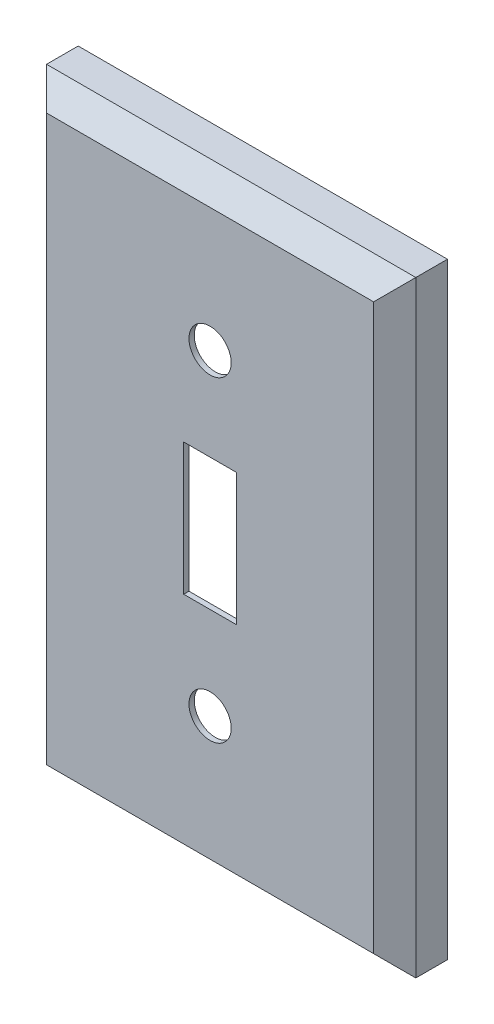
from build123d import *

# Parameters (mm, degrees)
SKETCH1_W          = 70
SKETCH1_H          = 115
BASE_EXTRUDE_DEPTH = 10
CHAMFER2_SIZE      = 4
SHELL1_T           = -1
SKETCH3_W          = 10
SKETCH3_H          = 25
SWITCHHOLE_DEPTH   = 136
SKETCH4_R          = 4
SCREWHOLE_DEPTH    = 136


with BuildPart() as part:
    # Sketch1 → Base-Extrude (new body)
    with BuildSketch(Plane.XY):
        with Locations((35, 57.5)):
            Rectangle(SKETCH1_W, SKETCH1_H)
    extrude(amount=BASE_EXTRUDE_DEPTH)

    # Chamfer2
    chamfer2_edges = [part.edges().sort_by_distance(p)[0] for p in [
        (70, 57.5, 10),
        (35, 115, 10),
        (0, 57.5, 10),
        (35, 0, 10),
    ]]
    chamfer(chamfer2_edges, length=CHAMFER2_SIZE)

    # Shell1
    shell1_openings = [part.faces().sort_by_distance(p)[0] for p in [
        (35, 57.5, 0),
    ]]
    offset(amount=SHELL1_T, openings=shell1_openings, kind=Kind.INTERSECTION)

    # Sketch3 → switchhole (cut, through all)
    with BuildSketch(Plane(origin=(0, 0, 0), x_dir=(-1, 0, 0), z_dir=(0, 0, -1))):
        with Locations((-35, 57.5)):
            Rectangle(SKETCH3_W, SKETCH3_H)
    extrude(amount=-SWITCHHOLE_DEPTH, mode=Mode.SUBTRACT)

    # Sketch4 → screwhole (cut, through all)
    with BuildSketch(Plane(origin=(0, 0, 0), x_dir=(-1, 0, 0), z_dir=(0, 0, -1))):
        with Locations((-35, 87.5)):
            Circle(SKETCH4_R)
        with Locations((-35, 27.5)):
            Circle(SKETCH4_R)
    extrude(amount=-SCREWHOLE_DEPTH, mode=Mode.SUBTRACT)


solid = part.part
